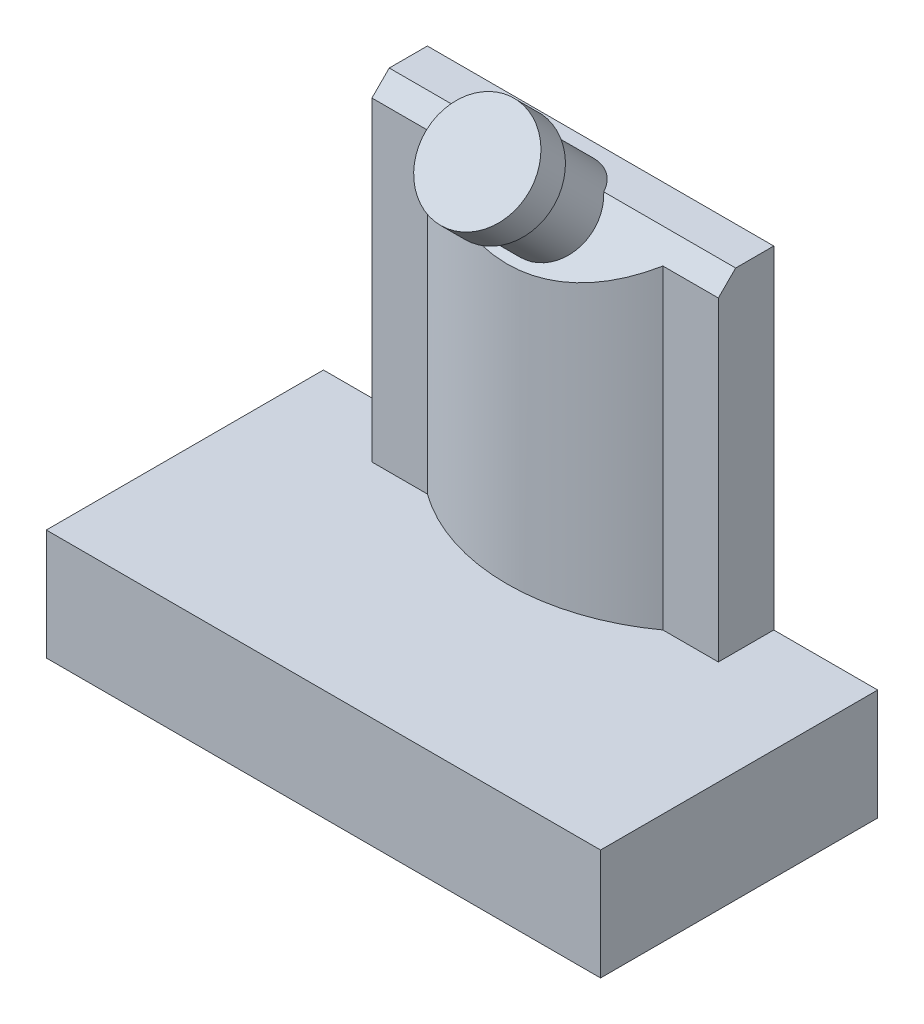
from build123d import *

# Parameters (mm, degrees)
SKIZZE1_W                           = 16
SKIZZE1_H                           = 8
LINEAR_AUSTRAGEN1_DEPTH             = 3.2
SKIZZE2_W                           = 12.8
SKIZZE2_H                           = 4.8
SCHNITT_LINEAR_AUSTRAGEN1_DEPTH     = 2.1
SKIZZE3_R                           = 1.5
SKIZZE3_R_2                         = 0.8
LINEAR_AUSTRAGEN2_DEPTH             = 2
VERRUNDUNG1_R                       = 0.1
LINEAR_AUSTRAGEN3_DEPTH             = 9.6
SCHNITT_LINEAR_AUSTRAGEN2_DEPTH     = 20.920843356
SKIZZE6_R                           = 1.249999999
LINEAR_AUSTRAGEN4_DEPTH             = 3
LINEAR_AUSTRAGEN4_DIRECTION_2_REACH = 23.747
SKIZZE7_R                           = 1.499999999
LINEAR_AUSTRAGEN5_DEPTH             = 1


with BuildPart() as part:
    # Skizze1 → Linear austragen1 (new body)
    with BuildSketch(Plane(origin=(0, 0, 0), x_dir=(1, 0, 0), z_dir=(0, 1, 0))):
        with Locations((8, 4)):
            Rectangle(SKIZZE1_W, SKIZZE1_H)
    extrude(amount=LINEAR_AUSTRAGEN1_DEPTH)

    # Skizze2 → Schnitt-Linear austragen1 (cut)
    with BuildSketch(Plane.XZ):
        with Locations((8, -4)):
            Rectangle(SKIZZE2_W, SKIZZE2_H)
    extrude(amount=-SCHNITT_LINEAR_AUSTRAGEN1_DEPTH, mode=Mode.SUBTRACT)

    # Skizze3 → Linear austragen2 (add)
    with BuildSketch(Plane.XZ.offset(-2.1)):
        with Locations(Location((8.2, -3.9, 0), (0, 0, 270))):
            Circle(SKIZZE3_R)
        with Locations(Location((8.2, -3.9, 0), (0, 0, 270))):
            Circle(SKIZZE3_R_2, mode=Mode.SUBTRACT)
    extrude(amount=LINEAR_AUSTRAGEN2_DEPTH)

    # Verrundung1
    verrundung1_edges = [part.edges().sort_by_distance(p)[0] for p in [
        (8.2, 0.1, -3.1),
    ]]
    fillet(verrundung1_edges, radius=VERRUNDUNG1_R)

    # Skizze4 → Linear austragen3 (add)
    with BuildSketch(Plane(origin=(0, 3.2, 0), x_dir=(-1, 0, 0), z_dir=(0, 1, 0))):
        with BuildLine():
            Line((-3, -8), (-13, -8))
            Line((-13, -8), (-13, -6.4))
            Line((-13, -6.4), (-11.4, -6.4))
            ThreePointArc((-11.4, -6.4), (-8, -5.3), (-4.6, -6.4))
            Line((-4.6, -6.4), (-3, -6.4))
            Line((-3, -6.4), (-3, -8))
        make_face()
    extrude(amount=LINEAR_AUSTRAGEN3_DEPTH)

    # Skizze5 → Schnitt-Linear austragen2 (cut, through all)
    with BuildSketch(Plane(origin=(13, 0, 0), x_dir=(0, 0, -1), z_dir=(1, 0, 0))):
        Polygon((6.9, 12.8), (5.3, 11.2), (5.3, 12.8), align=None)
    extrude(amount=-SCHNITT_LINEAR_AUSTRAGEN2_DEPTH, mode=Mode.SUBTRACT)

    # Skizze6 → Linear austragen4 (add)
    with BuildSketch(Plane(origin=(0, 2.95, 2.95), x_dir=(1, 0, 0), z_dir=(0, 0.7071067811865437, 0.7071067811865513))):
        with Locations(Location((8.2, 13.170682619, 0), (0, 0, 270))):
            Circle(SKIZZE6_R)
    extrude(amount=LINEAR_AUSTRAGEN4_DEPTH)

    # Skizze6 → Linear austragen4 direction 2 (add, up to next)
    with BuildSketch(Plane(origin=(0, 2.95, 2.95), x_dir=(1, 0, 0), z_dir=(0, 0.7071067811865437, 0.7071067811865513)), mode=Mode.PRIVATE) as linear_austragen4_direction_2_sk1:
        with Locations(Location((8.2, 13.170682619, 0), (0, 0, 270))):
            Circle(SKIZZE6_R)
    linear_austragen4_direction_2_tool1 = extrude(linear_austragen4_direction_2_sk1.sketch, amount=-LINEAR_AUSTRAGEN4_DIRECTION_2_REACH, mode=Mode.PRIVATE) - part.part
    add(linear_austragen4_direction_2_tool1.solids().sort_by_distance((8.2, 12.263079, -6.363079))[0])

    # Skizze7 → Linear austragen5 (add)
    with BuildSketch(Plane(origin=(0, 5.071320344, 5.071320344), x_dir=(1, 0, 0), z_dir=(0, 0.7071067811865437, 0.7071067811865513))):
        with Locations(Location((8.2, 13.170682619, 0), (0, 0, 270))):
            Circle(SKIZZE7_R)
    extrude(amount=-LINEAR_AUSTRAGEN5_DEPTH)


solid = part.part
